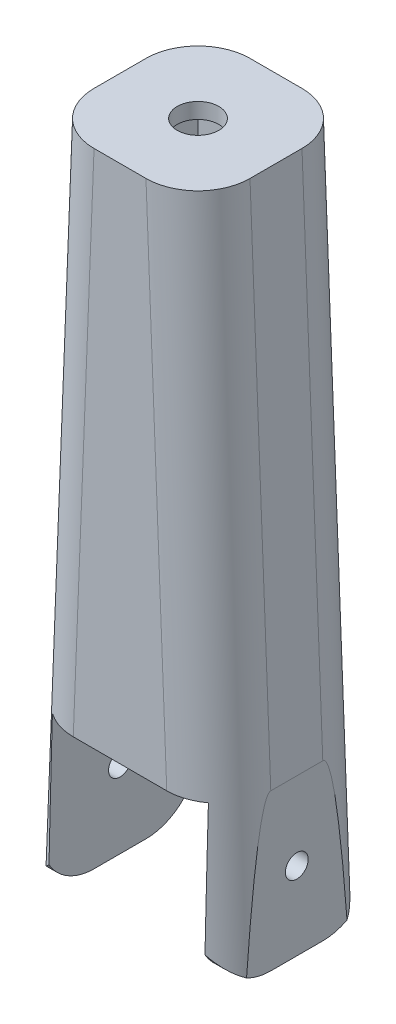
ISO-10303-21;
HEADER;
FILE_DESCRIPTION(('STEP AP214'),'2;1');
FILE_NAME('part.step','',(''),(''),'','','');
FILE_SCHEMA(('AUTOMOTIVE_DESIGN { 1 0 10303 214 1 1 1 1 }'));
ENDSEC;
DATA;
#1=APPLICATION_CONTEXT('core data for automotive mechanical design processes');
#2=APPLICATION_PROTOCOL_DEFINITION('international standard','automotive_design',2000,#1);
#3=PRODUCT_CONTEXT('',#1,'mechanical');
#4=PRODUCT('Part','Part','',(#3));
#5=PRODUCT_RELATED_PRODUCT_CATEGORY('part','',(#4));
#6=PRODUCT_DEFINITION_FORMATION('','',#4);
#7=PRODUCT_DEFINITION_CONTEXT('part definition',#1,'design');
#8=PRODUCT_DEFINITION('design','',#6,#7);
#9=PRODUCT_DEFINITION_SHAPE('','',#8);
#10=(LENGTH_UNIT() NAMED_UNIT(*) SI_UNIT(.MILLI.,.METRE.));
#11=(NAMED_UNIT(*) PLANE_ANGLE_UNIT() SI_UNIT($,.RADIAN.));
#12=(NAMED_UNIT(*) SI_UNIT($,.STERADIAN.) SOLID_ANGLE_UNIT());
#13=UNCERTAINTY_MEASURE_WITH_UNIT(LENGTH_MEASURE(1.E-05),#10,'distance_accuracy_value','');
#14=(GEOMETRIC_REPRESENTATION_CONTEXT(3) GLOBAL_UNCERTAINTY_ASSIGNED_CONTEXT((#13)) GLOBAL_UNIT_ASSIGNED_CONTEXT((#10,
#11,#12)) REPRESENTATION_CONTEXT('',''));
#15=CARTESIAN_POINT('',(0.,0.,0.));
#16=DIRECTION('',(0.,0.,1.));
#17=DIRECTION('',(1.,0.,0.));
#18=AXIS2_PLACEMENT_3D('',#15,#16,#17);
#19=CARTESIAN_POINT('',(0.,0.,0.));
#20=DIRECTION('',(0.,-1.,0.));
#21=DIRECTION('',(0.,0.,-1.));
#22=AXIS2_PLACEMENT_3D('',#19,#20,#21);
#23=PLANE('',#22);
#24=DIRECTION('',(0.,0.,1.));
#25=VECTOR('',#24,1.);
#26=CARTESIAN_POINT('',(10.,0.,10.));
#27=LINE('',#26,#25);
#28=CARTESIAN_POINT('',(10.,0.,-10.));
#29=VERTEX_POINT('',#28);
#30=CARTESIAN_POINT('',(10.,0.,10.));
#31=VERTEX_POINT('',#30);
#32=EDGE_CURVE('E198',#29,#31,#27,.T.);
#33=ORIENTED_EDGE('',*,*,#32,.F.);
#34=DIRECTION('',(1.,0.,0.));
#35=VECTOR('',#34,1.);
#36=CARTESIAN_POINT('',(10.,0.,-10.));
#37=LINE('',#36,#35);
#38=CARTESIAN_POINT('',(-10.,0.,-10.));
#39=VERTEX_POINT('',#38);
#40=EDGE_CURVE('E215',#39,#29,#37,.T.);
#41=ORIENTED_EDGE('',*,*,#40,.F.);
#42=DIRECTION('',(0.,0.,-1.));
#43=VECTOR('',#42,1.);
#44=CARTESIAN_POINT('',(-10.,0.,10.));
#45=LINE('',#44,#43);
#46=CARTESIAN_POINT('',(-10.,0.,10.));
#47=VERTEX_POINT('',#46);
#48=EDGE_CURVE('E218',#47,#39,#45,.T.);
#49=ORIENTED_EDGE('',*,*,#48,.F.);
#50=DIRECTION('',(-1.,0.,0.));
#51=VECTOR('',#50,1.);
#52=CARTESIAN_POINT('',(10.,0.,10.));
#53=LINE('',#52,#51);
#54=EDGE_CURVE('E226',#31,#47,#53,.T.);
#55=ORIENTED_EDGE('',*,*,#54,.F.);
#56=EDGE_LOOP('',(#33,#41,#49,#55));
#57=FACE_BOUND('',#56,.T.);
#58=DIRECTION('',(-1.,0.,0.));
#59=VECTOR('',#58,1.);
#60=CARTESIAN_POINT('',(-15.,0.,-15.));
#61=LINE('',#60,#59);
#62=CARTESIAN_POINT('',(8.99200319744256,0.,-15.));
#63=VERTEX_POINT('',#62);
#64=CARTESIAN_POINT('',(-8.99200319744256,0.,-15.));
#65=VERTEX_POINT('',#64);
#66=EDGE_CURVE('E270',#63,#65,#61,.T.);
#67=ORIENTED_EDGE('',*,*,#66,.F.);
#68=CARTESIAN_POINT('',(8.99200319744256,0.,-5.));
#69=DIRECTION('',(0.,-1.,0.));
#70=DIRECTION('',(-1.,0.,0.));
#71=AXIS2_PLACEMENT_3D('',#68,#69,#70);
#72=ELLIPSE('',#71,10.0079968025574,10.);
#73=CARTESIAN_POINT('',(15.,0.,-12.9976018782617));
#74=VERTEX_POINT('',#73);
#75=EDGE_CURVE('E333',#63,#74,#72,.T.);
#76=ORIENTED_EDGE('',*,*,#75,.T.);
#77=DIRECTION('',(0.,0.,1.));
#78=VECTOR('',#77,1.);
#79=CARTESIAN_POINT('',(15.,0.,15.));
#80=LINE('',#79,#78);
#81=CARTESIAN_POINT('',(15.,0.,12.9976018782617));
#82=VERTEX_POINT('',#81);
#83=EDGE_CURVE('E263',#74,#82,#80,.T.);
#84=ORIENTED_EDGE('',*,*,#83,.T.);
#85=CARTESIAN_POINT('',(8.99200319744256,0.,5.));
#86=DIRECTION('',(0.,-1.,0.));
#87=DIRECTION('',(-1.,0.,0.));
#88=AXIS2_PLACEMENT_3D('',#85,#86,#87);
#89=ELLIPSE('',#88,10.0079968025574,10.);
#90=CARTESIAN_POINT('',(8.99200319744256,0.,15.));
#91=VERTEX_POINT('',#90);
#92=EDGE_CURVE('E331',#82,#91,#89,.T.);
#93=ORIENTED_EDGE('',*,*,#92,.T.);
#94=DIRECTION('',(1.,0.,0.));
#95=VECTOR('',#94,1.);
#96=CARTESIAN_POINT('',(-15.,0.,15.));
#97=LINE('',#96,#95);
#98=CARTESIAN_POINT('',(-8.99200319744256,0.,15.));
#99=VERTEX_POINT('',#98);
#100=EDGE_CURVE('E275',#99,#91,#97,.T.);
#101=ORIENTED_EDGE('',*,*,#100,.F.);
#102=CARTESIAN_POINT('',(-8.99200319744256,0.,5.));
#103=DIRECTION('',(0.,-1.,0.));
#104=DIRECTION('',(-1.,0.,0.));
#105=AXIS2_PLACEMENT_3D('',#102,#103,#104);
#106=ELLIPSE('',#105,10.0079968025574,10.);
#107=CARTESIAN_POINT('',(-15.,0.,12.9976018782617));
#108=VERTEX_POINT('',#107);
#109=EDGE_CURVE('E327',#99,#108,#106,.T.);
#110=ORIENTED_EDGE('',*,*,#109,.T.);
#111=DIRECTION('',(0.,0.,-1.));
#112=VECTOR('',#111,1.);
#113=CARTESIAN_POINT('',(-15.,0.,-15.));
#114=LINE('',#113,#112);
#115=CARTESIAN_POINT('',(-15.,0.,-12.9976018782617));
#116=VERTEX_POINT('',#115);
#117=EDGE_CURVE('E251',#108,#116,#114,.T.);
#118=ORIENTED_EDGE('',*,*,#117,.T.);
#119=CARTESIAN_POINT('',(-8.99200319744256,0.,-5.));
#120=DIRECTION('',(0.,-1.,0.));
#121=DIRECTION('',(-1.,0.,0.));
#122=AXIS2_PLACEMENT_3D('',#119,#120,#121);
#123=ELLIPSE('',#122,10.0079968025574,10.);
#124=EDGE_CURVE('E329',#116,#65,#123,.T.);
#125=ORIENTED_EDGE('',*,*,#124,.T.);
#126=EDGE_LOOP('',(#67,#76,#84,#93,#101,#110,#118,#125));
#127=FACE_BOUND('',#126,.T.);
#128=ADVANCED_FACE('F41',(#57,#127),#23,.T.);
#129=CARTESIAN_POINT('',(-15.,100.,-15.));
#130=DIRECTION('',(0.,0.,1.));
#131=DIRECTION('',(1.,0.,0.));
#132=AXIS2_PLACEMENT_3D('',#129,#130,#131);
#133=PLANE('',#132);
#134=DIRECTION('',(-1.,0.,0.));
#135=VECTOR('',#134,1.);
#136=CARTESIAN_POINT('',(-15.,100.,-15.));
#137=LINE('',#136,#135);
#138=CARTESIAN_POINT('',(4.99200319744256,100.,-15.));
#139=VERTEX_POINT('',#138);
#140=CARTESIAN_POINT('',(-4.99200319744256,100.,-15.));
#141=VERTEX_POINT('',#140);
#142=EDGE_CURVE('E274',#139,#141,#137,.T.);
#143=ORIENTED_EDGE('',*,*,#142,.F.);
#144=DIRECTION('',(0.0399680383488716,-0.99920095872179,0.));
#145=VECTOR('',#144,1.);
#146=CARTESIAN_POINT('',(9.00799041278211,-0.399680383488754,-15.));
#147=LINE('',#146,#145);
#148=EDGE_CURVE('E324',#139,#63,#147,.T.);
#149=ORIENTED_EDGE('',*,*,#148,.T.);
#150=ORIENTED_EDGE('',*,*,#66,.T.);
#151=DIRECTION('',(0.0399680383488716,0.99920095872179,0.));
#152=VECTOR('',#151,1.);
#153=CARTESIAN_POINT('',(-5.00799041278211,99.6003196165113,-15.));
#154=LINE('',#153,#152);
#155=EDGE_CURVE('E317',#65,#141,#154,.T.);
#156=ORIENTED_EDGE('',*,*,#155,.T.);
#157=EDGE_LOOP('',(#143,#149,#150,#156));
#158=FACE_BOUND('',#157,.T.);
#159=ADVANCED_FACE('F389',(#158),#133,.F.);
#160=CARTESIAN_POINT('',(-15.,100.,15.));
#161=DIRECTION('',(0.,0.,-1.));
#162=DIRECTION('',(-1.,0.,0.));
#163=AXIS2_PLACEMENT_3D('',#160,#161,#162);
#164=PLANE('',#163);
#165=ORIENTED_EDGE('',*,*,#100,.T.);
#166=DIRECTION('',(0.0399680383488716,-0.99920095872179,0.));
#167=VECTOR('',#166,1.);
#168=CARTESIAN_POINT('',(5.0079904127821,99.6003196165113,15.));
#169=LINE('',#168,#167);
#170=CARTESIAN_POINT('',(4.99200319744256,100.,15.));
#171=VERTEX_POINT('',#170);
#172=EDGE_CURVE('E362',#91,#171,#169,.F.);
#173=ORIENTED_EDGE('',*,*,#172,.T.);
#174=DIRECTION('',(1.,0.,0.));
#175=VECTOR('',#174,1.);
#176=CARTESIAN_POINT('',(-15.,100.,15.));
#177=LINE('',#176,#175);
#178=CARTESIAN_POINT('',(-4.99200319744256,100.,15.));
#179=VERTEX_POINT('',#178);
#180=EDGE_CURVE('E281',#179,#171,#177,.T.);
#181=ORIENTED_EDGE('',*,*,#180,.F.);
#182=DIRECTION('',(0.0399680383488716,0.99920095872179,0.));
#183=VECTOR('',#182,1.);
#184=CARTESIAN_POINT('',(-9.00799041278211,-0.399680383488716,15.));
#185=LINE('',#184,#183);
#186=EDGE_CURVE('E360',#179,#99,#185,.F.);
#187=ORIENTED_EDGE('',*,*,#186,.T.);
#188=EDGE_LOOP('',(#165,#173,#181,#187));
#189=FACE_BOUND('',#188,.T.);
#190=ADVANCED_FACE('F429',(#189),#164,.F.);
#191=CARTESIAN_POINT('',(0.,100.,0.));
#192=DIRECTION('',(0.,-1.,0.));
#193=DIRECTION('',(0.,0.,-1.));
#194=AXIS2_PLACEMENT_3D('',#191,#192,#193);
#195=PLANE('',#194);
#196=CARTESIAN_POINT('',(0.,100.,0.));
#197=DIRECTION('',(0.,1.,0.));
#198=DIRECTION('',(0.,0.,1.));
#199=AXIS2_PLACEMENT_3D('',#196,#197,#198);
#200=CIRCLE('',#199,4.);
#201=CARTESIAN_POINT('',(0.,100.,4.));
#202=VERTEX_POINT('',#201);
#203=EDGE_CURVE('E221',#202,#202,#200,.T.);
#204=ORIENTED_EDGE('',*,*,#203,.F.);
#205=EDGE_LOOP('',(#204));
#206=FACE_BOUND('',#205,.T.);
#207=DIRECTION('',(0.,0.,-1.));
#208=VECTOR('',#207,1.);
#209=CARTESIAN_POINT('',(15.,100.,15.));
#210=LINE('',#209,#208);
#211=CARTESIAN_POINT('',(15.,100.,5.));
#212=VERTEX_POINT('',#211);
#213=CARTESIAN_POINT('',(15.,100.,-5.));
#214=VERTEX_POINT('',#213);
#215=EDGE_CURVE('E271',#212,#214,#210,.T.);
#216=ORIENTED_EDGE('',*,*,#215,.T.);
#217=CARTESIAN_POINT('',(4.99200319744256,100.,-5.));
#218=DIRECTION('',(0.,-1.,0.));
#219=DIRECTION('',(-1.,0.,0.));
#220=AXIS2_PLACEMENT_3D('',#217,#218,#219);
#221=ELLIPSE('',#220,10.0079968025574,10.);
#222=EDGE_CURVE('E356',#214,#139,#221,.F.);
#223=ORIENTED_EDGE('',*,*,#222,.T.);
#224=ORIENTED_EDGE('',*,*,#142,.T.);
#225=CARTESIAN_POINT('',(-4.99200319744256,100.,-5.));
#226=DIRECTION('',(0.,-1.,0.));
#227=DIRECTION('',(-1.,0.,0.));
#228=AXIS2_PLACEMENT_3D('',#225,#226,#227);
#229=ELLIPSE('',#228,10.0079968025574,10.);
#230=CARTESIAN_POINT('',(-15.,100.,-5.));
#231=VERTEX_POINT('',#230);
#232=EDGE_CURVE('E352',#141,#231,#229,.F.);
#233=ORIENTED_EDGE('',*,*,#232,.T.);
#234=DIRECTION('',(0.,0.,1.));
#235=VECTOR('',#234,1.);
#236=CARTESIAN_POINT('',(-15.,100.,15.));
#237=LINE('',#236,#235);
#238=CARTESIAN_POINT('',(-15.,100.,5.));
#239=VERTEX_POINT('',#238);
#240=EDGE_CURVE('E278',#231,#239,#237,.T.);
#241=ORIENTED_EDGE('',*,*,#240,.T.);
#242=CARTESIAN_POINT('',(-4.99200319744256,100.,5.));
#243=DIRECTION('',(0.,-1.,0.));
#244=DIRECTION('',(-1.,0.,0.));
#245=AXIS2_PLACEMENT_3D('',#242,#243,#244);
#246=ELLIPSE('',#245,10.0079968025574,10.);
#247=EDGE_CURVE('E350',#239,#179,#246,.F.);
#248=ORIENTED_EDGE('',*,*,#247,.T.);
#249=ORIENTED_EDGE('',*,*,#180,.T.);
#250=CARTESIAN_POINT('',(4.99200319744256,100.,5.));
#251=DIRECTION('',(0.,-1.,0.));
#252=DIRECTION('',(-1.,0.,0.));
#253=AXIS2_PLACEMENT_3D('',#250,#251,#252);
#254=ELLIPSE('',#253,10.0079968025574,10.);
#255=EDGE_CURVE('E354',#171,#212,#254,.F.);
#256=ORIENTED_EDGE('',*,*,#255,.T.);
#257=EDGE_LOOP('',(#216,#223,#224,#233,#241,#248,#249,#256));
#258=FACE_BOUND('',#257,.T.);
#259=ADVANCED_FACE('F392',(#206,#258),#195,.F.);
#260=CARTESIAN_POINT('',(19.,0.,15.));
#261=DIRECTION('',(0.999200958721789,0.0399680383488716,0.));
#262=DIRECTION('',(-0.0399680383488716,0.99920095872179,0.));
#263=AXIS2_PLACEMENT_3D('',#260,#261,#262);
#264=PLANE('',#263);
#265=DIRECTION('',(0.,0.,-1.));
#266=VECTOR('',#265,1.);
#267=CARTESIAN_POINT('',(19.,0.,15.));
#268=LINE('',#267,#266);
#269=CARTESIAN_POINT('',(19.,0.,5.));
#270=VERTEX_POINT('',#269);
#271=CARTESIAN_POINT('',(19.,0.,-5.));
#272=VERTEX_POINT('',#271);
#273=EDGE_CURVE('E262',#270,#272,#268,.T.);
#274=ORIENTED_EDGE('',*,*,#273,.T.);
#275=DIRECTION('',(0.0399680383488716,-0.99920095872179,0.));
#276=VECTOR('',#275,1.);
#277=CARTESIAN_POINT('',(15.,100.,-5.));
#278=LINE('',#277,#276);
#279=EDGE_CURVE('E348',#272,#214,#278,.F.);
#280=ORIENTED_EDGE('',*,*,#279,.T.);
#281=ORIENTED_EDGE('',*,*,#215,.F.);
#282=DIRECTION('',(0.0399680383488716,-0.99920095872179,0.));
#283=VECTOR('',#282,1.);
#284=CARTESIAN_POINT('',(19.,0.,5.));
#285=LINE('',#284,#283);
#286=EDGE_CURVE('E345',#212,#270,#285,.T.);
#287=ORIENTED_EDGE('',*,*,#286,.T.);
#288=EDGE_LOOP('',(#274,#280,#281,#287));
#289=FACE_BOUND('',#288,.T.);
#290=ADVANCED_FACE('F452',(#289),#264,.T.);
#291=CARTESIAN_POINT('',(19.,-30.,15.));
#292=DIRECTION('',(0.,1.,0.));
#293=DIRECTION('',(0.,0.,1.));
#294=AXIS2_PLACEMENT_3D('',#291,#292,#293);
#295=PLANE('',#294);
#296=DIRECTION('',(0.,0.,-1.));
#297=VECTOR('',#296,1.);
#298=CARTESIAN_POINT('',(19.,-30.,15.));
#299=LINE('',#298,#297);
#300=CARTESIAN_POINT('',(19.,-30.,5.));
#301=VERTEX_POINT('',#300);
#302=CARTESIAN_POINT('',(19.,-30.,-5.));
#303=VERTEX_POINT('',#302);
#304=EDGE_CURVE('E259',#301,#303,#299,.T.);
#305=ORIENTED_EDGE('',*,*,#304,.F.);
#306=DIRECTION('',(-1.,0.,0.));
#307=VECTOR('',#306,1.);
#308=CARTESIAN_POINT('',(19.,-30.,5.));
#309=LINE('',#308,#307);
#310=CARTESIAN_POINT('',(15.,-30.,5.));
#311=VERTEX_POINT('',#310);
#312=EDGE_CURVE('E304',#301,#311,#309,.T.);
#313=ORIENTED_EDGE('',*,*,#312,.T.);
#314=DIRECTION('',(0.,0.,-1.));
#315=VECTOR('',#314,1.);
#316=CARTESIAN_POINT('',(15.,-30.,15.));
#317=LINE('',#316,#315);
#318=CARTESIAN_POINT('',(15.,-30.,-5.));
#319=VERTEX_POINT('',#318);
#320=EDGE_CURVE('E258',#311,#319,#317,.T.);
#321=ORIENTED_EDGE('',*,*,#320,.T.);
#322=DIRECTION('',(-1.,0.,0.));
#323=VECTOR('',#322,1.);
#324=CARTESIAN_POINT('',(19.,-30.,-5.));
#325=LINE('',#324,#323);
#326=EDGE_CURVE('E302',#319,#303,#325,.F.);
#327=ORIENTED_EDGE('',*,*,#326,.T.);
#328=EDGE_LOOP('',(#305,#313,#321,#327));
#329=FACE_BOUND('',#328,.T.);
#330=ADVANCED_FACE('F419',(#329),#295,.F.);
#331=CARTESIAN_POINT('',(19.,0.,0.));
#332=DIRECTION('',(1.,0.,0.));
#333=DIRECTION('',(0.,0.,-1.));
#334=AXIS2_PLACEMENT_3D('',#331,#332,#333);
#335=PLANE('',#334);
#336=CARTESIAN_POINT('',(19.,-15.,0.));
#337=DIRECTION('',(1.,0.,0.));
#338=DIRECTION('',(0.,0.,-1.));
#339=AXIS2_PLACEMENT_3D('',#336,#337,#338);
#340=CIRCLE('',#339,2.2);
#341=CARTESIAN_POINT('',(19.,-15.,-2.2));
#342=VERTEX_POINT('',#341);
#343=EDGE_CURVE('E233',#342,#342,#340,.T.);
#344=ORIENTED_EDGE('',*,*,#343,.F.);
#345=EDGE_LOOP('',(#344));
#346=FACE_BOUND('',#345,.T.);
#347=CARTESIAN_POINT('',(19.,-20.,-5.));
#348=DIRECTION('',(1.,0.,0.));
#349=DIRECTION('',(0.,0.,-1.));
#350=AXIS2_PLACEMENT_3D('',#347,#348,#349);
#351=CIRCLE('',#350,10.);
#352=CARTESIAN_POINT('',(19.,-28.8470403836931,-9.6615315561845));
#353=VERTEX_POINT('',#352);
#354=EDGE_CURVE('E312',#303,#353,#351,.T.);
#355=ORIENTED_EDGE('',*,*,#354,.T.);
#356=CARTESIAN_POINT('',(19.,-250.199920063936,-5.));
#357=DIRECTION('',(1.,0.,0.));
#358=DIRECTION('',(0.,1.,0.));
#359=AXIS2_PLACEMENT_3D('',#356,#357,#358);
#360=ELLIPSE('',#359,250.199920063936,10.);
#361=EDGE_CURVE('E343',#353,#272,#360,.T.);
#362=ORIENTED_EDGE('',*,*,#361,.T.);
#363=ORIENTED_EDGE('',*,*,#273,.F.);
#364=CARTESIAN_POINT('',(19.,-250.199920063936,5.));
#365=DIRECTION('',(1.,0.,0.));
#366=DIRECTION('',(0.,1.,0.));
#367=AXIS2_PLACEMENT_3D('',#364,#365,#366);
#368=ELLIPSE('',#367,250.199920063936,10.);
#369=CARTESIAN_POINT('',(19.,-28.8470403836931,9.66153155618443));
#370=VERTEX_POINT('',#369);
#371=EDGE_CURVE('E341',#270,#370,#368,.T.);
#372=ORIENTED_EDGE('',*,*,#371,.T.);
#373=CARTESIAN_POINT('',(19.,-20.,5.));
#374=DIRECTION('',(1.,0.,0.));
#375=DIRECTION('',(0.,0.,-1.));
#376=AXIS2_PLACEMENT_3D('',#373,#374,#375);
#377=CIRCLE('',#376,10.);
#378=EDGE_CURVE('E315',#370,#301,#377,.T.);
#379=ORIENTED_EDGE('',*,*,#378,.T.);
#380=ORIENTED_EDGE('',*,*,#304,.T.);
#381=EDGE_LOOP('',(#355,#362,#363,#372,#379,#380));
#382=FACE_BOUND('',#381,.T.);
#383=ADVANCED_FACE('F413',(#346,#382),#335,.T.);
#384=CARTESIAN_POINT('',(15.,0.,0.));
#385=DIRECTION('',(1.,0.,0.));
#386=DIRECTION('',(0.,0.,-1.));
#387=AXIS2_PLACEMENT_3D('',#384,#385,#386);
#388=PLANE('',#387);
#389=CARTESIAN_POINT('',(15.,-15.,0.));
#390=DIRECTION('',(1.,0.,0.));
#391=DIRECTION('',(0.,0.,-1.));
#392=AXIS2_PLACEMENT_3D('',#389,#390,#391);
#393=CIRCLE('',#392,2.2);
#394=CARTESIAN_POINT('',(15.,-15.,-2.2));
#395=VERTEX_POINT('',#394);
#396=EDGE_CURVE('E243',#395,#395,#393,.T.);
#397=ORIENTED_EDGE('',*,*,#396,.T.);
#398=EDGE_LOOP('',(#397));
#399=FACE_BOUND('',#398,.T.);
#400=ORIENTED_EDGE('',*,*,#83,.F.);
#401=CARTESIAN_POINT('',(15.,-150.199920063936,-5.));
#402=DIRECTION('',(1.,0.,0.));
#403=DIRECTION('',(0.,1.,0.));
#404=AXIS2_PLACEMENT_3D('',#401,#402,#403);
#405=ELLIPSE('',#404,250.199920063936,10.);
#406=CARTESIAN_POINT('',(15.,-25.0038416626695,-13.6580349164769));
#407=VERTEX_POINT('',#406);
#408=EDGE_CURVE('E337',#74,#407,#405,.F.);
#409=ORIENTED_EDGE('',*,*,#408,.T.);
#410=CARTESIAN_POINT('',(15.,-20.,-5.));
#411=DIRECTION('',(1.,0.,0.));
#412=DIRECTION('',(0.,0.,-1.));
#413=AXIS2_PLACEMENT_3D('',#410,#411,#412);
#414=CIRCLE('',#413,10.);
#415=EDGE_CURVE('E307',#407,#319,#414,.F.);
#416=ORIENTED_EDGE('',*,*,#415,.T.);
#417=ORIENTED_EDGE('',*,*,#320,.F.);
#418=CARTESIAN_POINT('',(15.,-20.,5.));
#419=DIRECTION('',(1.,0.,0.));
#420=DIRECTION('',(0.,0.,-1.));
#421=AXIS2_PLACEMENT_3D('',#418,#419,#420);
#422=CIRCLE('',#421,10.);
#423=CARTESIAN_POINT('',(15.,-25.0038416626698,13.6580349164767));
#424=VERTEX_POINT('',#423);
#425=EDGE_CURVE('E309',#311,#424,#422,.F.);
#426=ORIENTED_EDGE('',*,*,#425,.T.);
#427=CARTESIAN_POINT('',(15.,-150.199920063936,5.));
#428=DIRECTION('',(1.,0.,0.));
#429=DIRECTION('',(0.,1.,0.));
#430=AXIS2_PLACEMENT_3D('',#427,#428,#429);
#431=ELLIPSE('',#430,250.199920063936,10.);
#432=EDGE_CURVE('E335',#424,#82,#431,.F.);
#433=ORIENTED_EDGE('',*,*,#432,.T.);
#434=EDGE_LOOP('',(#400,#409,#416,#417,#426,#433));
#435=FACE_BOUND('',#434,.T.);
#436=ADVANCED_FACE('F404',(#399,#435),#388,.F.);
#437=CARTESIAN_POINT('',(-19.,0.,15.));
#438=DIRECTION('',(-0.999200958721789,0.0399680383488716,0.));
#439=DIRECTION('',(-0.0399680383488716,-0.99920095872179,0.));
#440=AXIS2_PLACEMENT_3D('',#437,#438,#439);
#441=PLANE('',#440);
#442=ORIENTED_EDGE('',*,*,#240,.F.);
#443=DIRECTION('',(0.0399680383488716,0.99920095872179,0.));
#444=VECTOR('',#443,1.);
#445=CARTESIAN_POINT('',(-19.,0.,-5.));
#446=LINE('',#445,#444);
#447=CARTESIAN_POINT('',(-19.,0.,-5.));
#448=VERTEX_POINT('',#447);
#449=EDGE_CURVE('E367',#231,#448,#446,.F.);
#450=ORIENTED_EDGE('',*,*,#449,.T.);
#451=DIRECTION('',(0.,0.,-1.));
#452=VECTOR('',#451,1.);
#453=CARTESIAN_POINT('',(-19.,0.,15.));
#454=LINE('',#453,#452);
#455=CARTESIAN_POINT('',(-19.,0.,5.));
#456=VERTEX_POINT('',#455);
#457=EDGE_CURVE('E250',#456,#448,#454,.T.);
#458=ORIENTED_EDGE('',*,*,#457,.F.);
#459=DIRECTION('',(0.0399680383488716,0.99920095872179,0.));
#460=VECTOR('',#459,1.);
#461=CARTESIAN_POINT('',(-15.,100.,5.));
#462=LINE('',#461,#460);
#463=EDGE_CURVE('E364',#456,#239,#462,.T.);
#464=ORIENTED_EDGE('',*,*,#463,.T.);
#465=EDGE_LOOP('',(#442,#450,#458,#464));
#466=FACE_BOUND('',#465,.T.);
#467=ADVANCED_FACE('F449',(#466),#441,.T.);
#468=CARTESIAN_POINT('',(-19.,-30.,-15.));
#469=DIRECTION('',(0.,1.,0.));
#470=DIRECTION('',(0.,0.,1.));
#471=AXIS2_PLACEMENT_3D('',#468,#469,#470);
#472=PLANE('',#471);
#473=DIRECTION('',(0.,0.,1.));
#474=VECTOR('',#473,1.);
#475=CARTESIAN_POINT('',(-15.,-30.,-15.));
#476=LINE('',#475,#474);
#477=CARTESIAN_POINT('',(-15.,-30.,-5.));
#478=VERTEX_POINT('',#477);
#479=CARTESIAN_POINT('',(-15.,-30.,4.99999999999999));
#480=VERTEX_POINT('',#479);
#481=EDGE_CURVE('E246',#478,#480,#476,.T.);
#482=ORIENTED_EDGE('',*,*,#481,.T.);
#483=DIRECTION('',(1.,0.,0.));
#484=VECTOR('',#483,1.);
#485=CARTESIAN_POINT('',(-19.,-30.,5.));
#486=LINE('',#485,#484);
#487=CARTESIAN_POINT('',(-19.,-30.,4.99999999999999));
#488=VERTEX_POINT('',#487);
#489=EDGE_CURVE('E295',#480,#488,#486,.F.);
#490=ORIENTED_EDGE('',*,*,#489,.T.);
#491=DIRECTION('',(0.,0.,1.));
#492=VECTOR('',#491,1.);
#493=CARTESIAN_POINT('',(-19.,-30.,-15.));
#494=LINE('',#493,#492);
#495=CARTESIAN_POINT('',(-19.,-30.,-5.));
#496=VERTEX_POINT('',#495);
#497=EDGE_CURVE('E247',#496,#488,#494,.T.);
#498=ORIENTED_EDGE('',*,*,#497,.F.);
#499=DIRECTION('',(1.,0.,0.));
#500=VECTOR('',#499,1.);
#501=CARTESIAN_POINT('',(-19.,-30.,-5.));
#502=LINE('',#501,#500);
#503=EDGE_CURVE('E292',#496,#478,#502,.T.);
#504=ORIENTED_EDGE('',*,*,#503,.T.);
#505=EDGE_LOOP('',(#482,#490,#498,#504));
#506=FACE_BOUND('',#505,.T.);
#507=ADVANCED_FACE('F446',(#506),#472,.F.);
#508=CARTESIAN_POINT('',(-19.,0.,0.));
#509=DIRECTION('',(-1.,0.,0.));
#510=DIRECTION('',(0.,0.,1.));
#511=AXIS2_PLACEMENT_3D('',#508,#509,#510);
#512=PLANE('',#511);
#513=CARTESIAN_POINT('',(-19.,-15.,0.));
#514=DIRECTION('',(1.,0.,0.));
#515=DIRECTION('',(0.,0.,-1.));
#516=AXIS2_PLACEMENT_3D('',#513,#514,#515);
#517=CIRCLE('',#516,2.2);
#518=CARTESIAN_POINT('',(-19.,-15.,-2.2));
#519=VERTEX_POINT('',#518);
#520=EDGE_CURVE('E237',#519,#519,#517,.T.);
#521=ORIENTED_EDGE('',*,*,#520,.T.);
#522=EDGE_LOOP('',(#521));
#523=FACE_BOUND('',#522,.T.);
#524=ORIENTED_EDGE('',*,*,#457,.T.);
#525=CARTESIAN_POINT('',(-19.,-250.199920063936,-5.));
#526=DIRECTION('',(-1.,0.,0.));
#527=DIRECTION('',(0.,-1.,0.));
#528=AXIS2_PLACEMENT_3D('',#525,#526,#527);
#529=ELLIPSE('',#528,250.199920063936,10.);
#530=CARTESIAN_POINT('',(-19.,-28.8470403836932,-9.66153155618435));
#531=VERTEX_POINT('',#530);
#532=EDGE_CURVE('E371',#448,#531,#529,.T.);
#533=ORIENTED_EDGE('',*,*,#532,.T.);
#534=CARTESIAN_POINT('',(-19.,-20.,-5.));
#535=DIRECTION('',(-1.,0.,0.));
#536=DIRECTION('',(0.,0.,1.));
#537=AXIS2_PLACEMENT_3D('',#534,#535,#536);
#538=CIRCLE('',#537,10.);
#539=EDGE_CURVE('E297',#531,#496,#538,.T.);
#540=ORIENTED_EDGE('',*,*,#539,.T.);
#541=ORIENTED_EDGE('',*,*,#497,.T.);
#542=CARTESIAN_POINT('',(-19.,-20.,5.));
#543=DIRECTION('',(-1.,0.,0.));
#544=DIRECTION('',(0.,0.,1.));
#545=AXIS2_PLACEMENT_3D('',#542,#543,#544);
#546=CIRCLE('',#545,10.);
#547=CARTESIAN_POINT('',(-19.,-28.8470403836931,9.66153155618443));
#548=VERTEX_POINT('',#547);
#549=EDGE_CURVE('E299',#488,#548,#546,.T.);
#550=ORIENTED_EDGE('',*,*,#549,.T.);
#551=CARTESIAN_POINT('',(-19.,-250.199920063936,5.));
#552=DIRECTION('',(-1.,0.,0.));
#553=DIRECTION('',(0.,-1.,0.));
#554=AXIS2_PLACEMENT_3D('',#551,#552,#553);
#555=ELLIPSE('',#554,250.199920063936,10.);
#556=EDGE_CURVE('E369',#548,#456,#555,.T.);
#557=ORIENTED_EDGE('',*,*,#556,.T.);
#558=EDGE_LOOP('',(#524,#533,#540,#541,#550,#557));
#559=FACE_BOUND('',#558,.T.);
#560=ADVANCED_FACE('F441',(#523,#559),#512,.T.);
#561=CARTESIAN_POINT('',(-15.,0.,0.));
#562=DIRECTION('',(-1.,0.,0.));
#563=DIRECTION('',(0.,0.,1.));
#564=AXIS2_PLACEMENT_3D('',#561,#562,#563);
#565=PLANE('',#564);
#566=CARTESIAN_POINT('',(-15.,-15.,0.));
#567=DIRECTION('',(-1.,0.,0.));
#568=DIRECTION('',(0.,0.,1.));
#569=AXIS2_PLACEMENT_3D('',#566,#567,#568);
#570=CIRCLE('',#569,2.2);
#571=CARTESIAN_POINT('',(-15.,-15.,2.2));
#572=VERTEX_POINT('',#571);
#573=EDGE_CURVE('E240',#572,#572,#570,.T.);
#574=ORIENTED_EDGE('',*,*,#573,.T.);
#575=EDGE_LOOP('',(#574));
#576=FACE_BOUND('',#575,.T.);
#577=CARTESIAN_POINT('',(-15.,-20.,-5.));
#578=DIRECTION('',(-1.,0.,0.));
#579=DIRECTION('',(0.,0.,1.));
#580=AXIS2_PLACEMENT_3D('',#577,#578,#579);
#581=CIRCLE('',#580,10.);
#582=CARTESIAN_POINT('',(-15.,-25.0038416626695,-13.6580349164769));
#583=VERTEX_POINT('',#582);
#584=EDGE_CURVE('E284',#478,#583,#581,.F.);
#585=ORIENTED_EDGE('',*,*,#584,.T.);
#586=CARTESIAN_POINT('',(-15.,-150.199920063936,-5.));
#587=DIRECTION('',(-1.,0.,0.));
#588=DIRECTION('',(0.,-1.,0.));
#589=AXIS2_PLACEMENT_3D('',#586,#587,#588);
#590=ELLIPSE('',#589,250.199920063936,10.);
#591=EDGE_CURVE('E49',#583,#116,#590,.F.);
#592=ORIENTED_EDGE('',*,*,#591,.T.);
#593=ORIENTED_EDGE('',*,*,#117,.F.);
#594=CARTESIAN_POINT('',(-15.,-150.199920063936,5.));
#595=DIRECTION('',(-1.,0.,0.));
#596=DIRECTION('',(0.,-1.,0.));
#597=AXIS2_PLACEMENT_3D('',#594,#595,#596);
#598=ELLIPSE('',#597,250.199920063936,10.);
#599=CARTESIAN_POINT('',(-15.,-25.0038416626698,13.6580349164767));
#600=VERTEX_POINT('',#599);
#601=EDGE_CURVE('E56',#108,#600,#598,.F.);
#602=ORIENTED_EDGE('',*,*,#601,.T.);
#603=CARTESIAN_POINT('',(-15.,-20.,5.));
#604=DIRECTION('',(-1.,0.,0.));
#605=DIRECTION('',(0.,0.,1.));
#606=AXIS2_PLACEMENT_3D('',#603,#604,#605);
#607=CIRCLE('',#606,10.);
#608=EDGE_CURVE('E290',#600,#480,#607,.F.);
#609=ORIENTED_EDGE('',*,*,#608,.T.);
#610=ORIENTED_EDGE('',*,*,#481,.F.);
#611=EDGE_LOOP('',(#585,#592,#593,#602,#609,#610));
#612=FACE_BOUND('',#611,.T.);
#613=ADVANCED_FACE('F375',(#576,#612),#565,.F.);
#614=CARTESIAN_POINT('',(-15.,-20.,5.));
#615=DIRECTION('',(1.,0.,0.));
#616=DIRECTION('',(0.,0.,-1.));
#617=AXIS2_PLACEMENT_3D('',#614,#615,#616);
#618=CYLINDRICAL_SURFACE('',#617,10.);
#619=ORIENTED_EDGE('',*,*,#608,.F.);
#620=CARTESIAN_POINT('',(-9.79200319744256,-20.,5.));
#621=DIRECTION('',(0.692831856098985,-0.721099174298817,0.));
#622=DIRECTION('',(0.721099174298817,0.692831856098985,0.));
#623=AXIS2_PLACEMENT_3D('',#620,#621,#622);
#624=ELLIPSE('',#623,14.4335164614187,10.);
#625=EDGE_CURVE('E11',#600,#548,#624,.T.);
#626=ORIENTED_EDGE('',*,*,#625,.T.);
#627=ORIENTED_EDGE('',*,*,#549,.F.);
#628=ORIENTED_EDGE('',*,*,#489,.F.);
#629=EDGE_LOOP('',(#619,#626,#627,#628));
#630=FACE_BOUND('',#629,.T.);
#631=ADVANCED_FACE('F438',(#630),#618,.T.);
#632=CARTESIAN_POINT('',(19.,-20.,5.));
#633=DIRECTION('',(-1.,0.,0.));
#634=DIRECTION('',(0.,0.,1.));
#635=AXIS2_PLACEMENT_3D('',#632,#633,#634);
#636=CYLINDRICAL_SURFACE('',#635,10.);
#637=ORIENTED_EDGE('',*,*,#378,.F.);
#638=CARTESIAN_POINT('',(9.79200319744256,-20.,5.));
#639=DIRECTION('',(-0.692831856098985,-0.721099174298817,0.));
#640=DIRECTION('',(-0.721099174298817,0.692831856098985,0.));
#641=AXIS2_PLACEMENT_3D('',#638,#639,#640);
#642=ELLIPSE('',#641,14.4335164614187,10.);
#643=EDGE_CURVE('E358',#370,#424,#642,.T.);
#644=ORIENTED_EDGE('',*,*,#643,.T.);
#645=ORIENTED_EDGE('',*,*,#425,.F.);
#646=ORIENTED_EDGE('',*,*,#312,.F.);
#647=EDGE_LOOP('',(#637,#644,#645,#646));
#648=FACE_BOUND('',#647,.T.);
#649=ADVANCED_FACE('F422',(#648),#636,.T.);
#650=CARTESIAN_POINT('',(-19.,-20.,-5.));
#651=DIRECTION('',(1.,0.,0.));
#652=DIRECTION('',(0.,0.,-1.));
#653=AXIS2_PLACEMENT_3D('',#650,#651,#652);
#654=CYLINDRICAL_SURFACE('',#653,10.);
#655=ORIENTED_EDGE('',*,*,#539,.F.);
#656=CARTESIAN_POINT('',(-9.79200319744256,-20.,-5.));
#657=DIRECTION('',(0.692831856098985,-0.721099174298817,0.));
#658=DIRECTION('',(0.721099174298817,0.692831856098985,0.));
#659=AXIS2_PLACEMENT_3D('',#656,#657,#658);
#660=ELLIPSE('',#659,14.4335164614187,10.);
#661=EDGE_CURVE('E64',#531,#583,#660,.T.);
#662=ORIENTED_EDGE('',*,*,#661,.T.);
#663=ORIENTED_EDGE('',*,*,#584,.F.);
#664=ORIENTED_EDGE('',*,*,#503,.F.);
#665=EDGE_LOOP('',(#655,#662,#663,#664));
#666=FACE_BOUND('',#665,.T.);
#667=ADVANCED_FACE('F447',(#666),#654,.T.);
#668=CARTESIAN_POINT('',(-15.,-20.,-5.));
#669=DIRECTION('',(-1.,0.,0.));
#670=DIRECTION('',(0.,0.,1.));
#671=AXIS2_PLACEMENT_3D('',#668,#669,#670);
#672=CYLINDRICAL_SURFACE('',#671,10.);
#673=ORIENTED_EDGE('',*,*,#415,.F.);
#674=CARTESIAN_POINT('',(9.79200319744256,-20.,-5.));
#675=DIRECTION('',(-0.692831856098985,-0.721099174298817,0.));
#676=DIRECTION('',(-0.721099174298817,0.692831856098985,0.));
#677=AXIS2_PLACEMENT_3D('',#674,#675,#676);
#678=ELLIPSE('',#677,14.4335164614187,10.);
#679=EDGE_CURVE('E339',#407,#353,#678,.T.);
#680=ORIENTED_EDGE('',*,*,#679,.T.);
#681=ORIENTED_EDGE('',*,*,#354,.F.);
#682=ORIENTED_EDGE('',*,*,#326,.F.);
#683=EDGE_LOOP('',(#673,#680,#681,#682));
#684=FACE_BOUND('',#683,.T.);
#685=ADVANCED_FACE('F410',(#684),#672,.T.);
#686=CARTESIAN_POINT('',(-19.,-15.,0.));
#687=DIRECTION('',(1.,0.,0.));
#688=DIRECTION('',(0.,0.,-1.));
#689=AXIS2_PLACEMENT_3D('',#686,#687,#688);
#690=CYLINDRICAL_SURFACE('',#689,2.2);
#691=ORIENTED_EDGE('',*,*,#520,.F.);
#692=EDGE_LOOP('',(#691));
#693=FACE_BOUND('',#692,.T.);
#694=ORIENTED_EDGE('',*,*,#573,.F.);
#695=EDGE_LOOP('',(#694));
#696=FACE_BOUND('',#695,.T.);
#697=ADVANCED_FACE('F482',(#693,#696),#690,.F.);
#698=ORIENTED_EDGE('',*,*,#343,.T.);
#699=EDGE_LOOP('',(#698));
#700=FACE_BOUND('',#699,.T.);
#701=ORIENTED_EDGE('',*,*,#396,.F.);
#702=EDGE_LOOP('',(#701));
#703=FACE_BOUND('',#702,.T.);
#704=ADVANCED_FACE('F564',(#700,#703),#690,.F.);
#705=CARTESIAN_POINT('',(10.,97.,10.));
#706=DIRECTION('',(1.,0.,0.));
#707=DIRECTION('',(0.,0.,-1.));
#708=AXIS2_PLACEMENT_3D('',#705,#706,#707);
#709=PLANE('',#708);
#710=ORIENTED_EDGE('',*,*,#32,.T.);
#711=DIRECTION('',(0.,-1.,0.));
#712=VECTOR('',#711,1.);
#713=CARTESIAN_POINT('',(10.,97.,10.));
#714=LINE('',#713,#712);
#715=CARTESIAN_POINT('',(10.,97.,10.));
#716=VERTEX_POINT('',#715);
#717=EDGE_CURVE('E191',#716,#31,#714,.T.);
#718=ORIENTED_EDGE('',*,*,#717,.F.);
#719=DIRECTION('',(0.,0.,1.));
#720=VECTOR('',#719,1.);
#721=CARTESIAN_POINT('',(10.,97.,10.));
#722=LINE('',#721,#720);
#723=CARTESIAN_POINT('',(10.,97.,-10.));
#724=VERTEX_POINT('',#723);
#725=EDGE_CURVE('E195',#724,#716,#722,.T.);
#726=ORIENTED_EDGE('',*,*,#725,.F.);
#727=DIRECTION('',(0.,-1.,0.));
#728=VECTOR('',#727,1.);
#729=CARTESIAN_POINT('',(10.,97.,-10.));
#730=LINE('',#729,#728);
#731=EDGE_CURVE('E231',#724,#29,#730,.T.);
#732=ORIENTED_EDGE('',*,*,#731,.T.);
#733=EDGE_LOOP('',(#710,#718,#726,#732));
#734=FACE_BOUND('',#733,.T.);
#735=ADVANCED_FACE('F193',(#734),#709,.F.);
#736=CARTESIAN_POINT('',(10.,97.,-10.));
#737=DIRECTION('',(0.,0.,-1.));
#738=DIRECTION('',(-1.,0.,0.));
#739=AXIS2_PLACEMENT_3D('',#736,#737,#738);
#740=PLANE('',#739);
#741=ORIENTED_EDGE('',*,*,#40,.T.);
#742=ORIENTED_EDGE('',*,*,#731,.F.);
#743=DIRECTION('',(1.,0.,0.));
#744=VECTOR('',#743,1.);
#745=CARTESIAN_POINT('',(10.,97.,-10.));
#746=LINE('',#745,#744);
#747=CARTESIAN_POINT('',(-10.,97.,-10.));
#748=VERTEX_POINT('',#747);
#749=EDGE_CURVE('E203',#748,#724,#746,.T.);
#750=ORIENTED_EDGE('',*,*,#749,.F.);
#751=DIRECTION('',(0.,-1.,0.));
#752=VECTOR('',#751,1.);
#753=CARTESIAN_POINT('',(-10.,97.,-10.));
#754=LINE('',#753,#752);
#755=EDGE_CURVE('E234',#748,#39,#754,.T.);
#756=ORIENTED_EDGE('',*,*,#755,.T.);
#757=EDGE_LOOP('',(#741,#742,#750,#756));
#758=FACE_BOUND('',#757,.T.);
#759=ADVANCED_FACE('F545',(#758),#740,.F.);
#760=CARTESIAN_POINT('',(-10.,97.,10.));
#761=DIRECTION('',(-1.,0.,0.));
#762=DIRECTION('',(0.,0.,1.));
#763=AXIS2_PLACEMENT_3D('',#760,#761,#762);
#764=PLANE('',#763);
#765=ORIENTED_EDGE('',*,*,#48,.T.);
#766=ORIENTED_EDGE('',*,*,#755,.F.);
#767=DIRECTION('',(0.,0.,-1.));
#768=VECTOR('',#767,1.);
#769=CARTESIAN_POINT('',(-10.,97.,10.));
#770=LINE('',#769,#768);
#771=CARTESIAN_POINT('',(-10.,97.,10.));
#772=VERTEX_POINT('',#771);
#773=EDGE_CURVE('E211',#772,#748,#770,.T.);
#774=ORIENTED_EDGE('',*,*,#773,.F.);
#775=DIRECTION('',(0.,-1.,0.));
#776=VECTOR('',#775,1.);
#777=CARTESIAN_POINT('',(-10.,97.,10.));
#778=LINE('',#777,#776);
#779=EDGE_CURVE('E202',#772,#47,#778,.T.);
#780=ORIENTED_EDGE('',*,*,#779,.T.);
#781=EDGE_LOOP('',(#765,#766,#774,#780));
#782=FACE_BOUND('',#781,.T.);
#783=ADVANCED_FACE('F536',(#782),#764,.F.);
#784=CARTESIAN_POINT('',(10.,97.,10.));
#785=DIRECTION('',(0.,0.,1.));
#786=DIRECTION('',(1.,0.,0.));
#787=AXIS2_PLACEMENT_3D('',#784,#785,#786);
#788=PLANE('',#787);
#789=ORIENTED_EDGE('',*,*,#54,.T.);
#790=ORIENTED_EDGE('',*,*,#779,.F.);
#791=DIRECTION('',(-1.,0.,0.));
#792=VECTOR('',#791,1.);
#793=CARTESIAN_POINT('',(10.,97.,10.));
#794=LINE('',#793,#792);
#795=EDGE_CURVE('E206',#716,#772,#794,.T.);
#796=ORIENTED_EDGE('',*,*,#795,.F.);
#797=ORIENTED_EDGE('',*,*,#717,.T.);
#798=EDGE_LOOP('',(#789,#790,#796,#797));
#799=FACE_BOUND('',#798,.T.);
#800=ADVANCED_FACE('F207',(#799),#788,.F.);
#801=CARTESIAN_POINT('',(0.,97.,0.));
#802=DIRECTION('',(0.,1.,0.));
#803=DIRECTION('',(0.,0.,1.));
#804=AXIS2_PLACEMENT_3D('',#801,#802,#803);
#805=PLANE('',#804);
#806=CARTESIAN_POINT('',(0.,97.,0.));
#807=DIRECTION('',(0.,1.,0.));
#808=DIRECTION('',(0.,0.,1.));
#809=AXIS2_PLACEMENT_3D('',#806,#807,#808);
#810=CIRCLE('',#809,4.);
#811=CARTESIAN_POINT('',(0.,97.,4.));
#812=VERTEX_POINT('',#811);
#813=EDGE_CURVE('E227',#812,#812,#810,.T.);
#814=ORIENTED_EDGE('',*,*,#813,.T.);
#815=EDGE_LOOP('',(#814));
#816=FACE_BOUND('',#815,.T.);
#817=ORIENTED_EDGE('',*,*,#725,.T.);
#818=ORIENTED_EDGE('',*,*,#795,.T.);
#819=ORIENTED_EDGE('',*,*,#773,.T.);
#820=ORIENTED_EDGE('',*,*,#749,.T.);
#821=EDGE_LOOP('',(#817,#818,#819,#820));
#822=FACE_BOUND('',#821,.T.);
#823=ADVANCED_FACE('F213',(#816,#822),#805,.F.);
#824=CARTESIAN_POINT('',(0.,-30.,0.));
#825=DIRECTION('',(0.,1.,0.));
#826=DIRECTION('',(0.,0.,1.));
#827=AXIS2_PLACEMENT_3D('',#824,#825,#826);
#828=CYLINDRICAL_SURFACE('',#827,4.);
#829=ORIENTED_EDGE('',*,*,#203,.T.);
#830=EDGE_LOOP('',(#829));
#831=FACE_BOUND('',#830,.T.);
#832=ORIENTED_EDGE('',*,*,#813,.F.);
#833=EDGE_LOOP('',(#832));
#834=FACE_BOUND('',#833,.T.);
#835=ADVANCED_FACE('F485',(#831,#834),#828,.F.);
#836=CARTESIAN_POINT('',(4.9600670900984,100.798402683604,-5.));
#837=DIRECTION('',(-0.0399680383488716,0.99920095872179,0.));
#838=DIRECTION('',(-0.999200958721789,-0.0399680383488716,0.));
#839=AXIS2_PLACEMENT_3D('',#836,#837,#838);
#840=CYLINDRICAL_SURFACE('',#839,10.);
#841=ORIENTED_EDGE('',*,*,#222,.F.);
#842=ORIENTED_EDGE('',*,*,#279,.F.);
#843=ORIENTED_EDGE('',*,*,#361,.F.);
#844=ORIENTED_EDGE('',*,*,#679,.F.);
#845=ORIENTED_EDGE('',*,*,#408,.F.);
#846=ORIENTED_EDGE('',*,*,#75,.F.);
#847=ORIENTED_EDGE('',*,*,#148,.F.);
#848=EDGE_LOOP('',(#841,#842,#843,#844,#845,#846,#847));
#849=FACE_BOUND('',#848,.T.);
#850=ADVANCED_FACE('F398',(#849),#840,.T.);
#851=CARTESIAN_POINT('',(9.00799041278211,-0.399680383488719,5.));
#852=DIRECTION('',(-0.0399680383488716,0.99920095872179,0.));
#853=DIRECTION('',(-0.999200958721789,-0.0399680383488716,0.));
#854=AXIS2_PLACEMENT_3D('',#851,#852,#853);
#855=CYLINDRICAL_SURFACE('',#854,10.);
#856=ORIENTED_EDGE('',*,*,#255,.F.);
#857=ORIENTED_EDGE('',*,*,#172,.F.);
#858=ORIENTED_EDGE('',*,*,#92,.F.);
#859=ORIENTED_EDGE('',*,*,#432,.F.);
#860=ORIENTED_EDGE('',*,*,#643,.F.);
#861=ORIENTED_EDGE('',*,*,#371,.F.);
#862=ORIENTED_EDGE('',*,*,#286,.F.);
#863=EDGE_LOOP('',(#856,#857,#858,#859,#860,#861,#862));
#864=FACE_BOUND('',#863,.T.);
#865=ADVANCED_FACE('F426',(#864),#855,.T.);
#866=CARTESIAN_POINT('',(-5.00799041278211,99.6003196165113,-5.));
#867=DIRECTION('',(-0.0399680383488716,-0.99920095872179,0.));
#868=DIRECTION('',(0.999200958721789,-0.0399680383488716,0.));
#869=AXIS2_PLACEMENT_3D('',#866,#867,#868);
#870=CYLINDRICAL_SURFACE('',#869,10.);
#871=ORIENTED_EDGE('',*,*,#532,.F.);
#872=ORIENTED_EDGE('',*,*,#449,.F.);
#873=ORIENTED_EDGE('',*,*,#232,.F.);
#874=ORIENTED_EDGE('',*,*,#155,.F.);
#875=ORIENTED_EDGE('',*,*,#124,.F.);
#876=ORIENTED_EDGE('',*,*,#591,.F.);
#877=ORIENTED_EDGE('',*,*,#661,.F.);
#878=EDGE_LOOP('',(#871,#872,#873,#874,#875,#876,#877));
#879=FACE_BOUND('',#878,.T.);
#880=ADVANCED_FACE('F385',(#879),#870,.T.);
#881=CARTESIAN_POINT('',(-9.00799041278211,-0.399680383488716,5.));
#882=DIRECTION('',(-0.0399680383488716,-0.99920095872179,0.));
#883=DIRECTION('',(0.999200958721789,-0.0399680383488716,0.));
#884=AXIS2_PLACEMENT_3D('',#881,#882,#883);
#885=CYLINDRICAL_SURFACE('',#884,10.);
#886=ORIENTED_EDGE('',*,*,#109,.F.);
#887=ORIENTED_EDGE('',*,*,#186,.F.);
#888=ORIENTED_EDGE('',*,*,#247,.F.);
#889=ORIENTED_EDGE('',*,*,#463,.F.);
#890=ORIENTED_EDGE('',*,*,#556,.F.);
#891=ORIENTED_EDGE('',*,*,#625,.F.);
#892=ORIENTED_EDGE('',*,*,#601,.F.);
#893=EDGE_LOOP('',(#886,#887,#888,#889,#890,#891,#892));
#894=FACE_BOUND('',#893,.T.);
#895=ADVANCED_FACE('F43',(#894),#885,.T.);
#896=CLOSED_SHELL('',(#128,#159,#190,#259,#290,#330,#383,#436,#467,#507,#560,#613,#631,#649,
#667,#685,#697,#704,#735,#759,#783,#800,#823,#835,#850,#865,#880,#895));
#897=MANIFOLD_SOLID_BREP('B2',#896);
#898=ADVANCED_BREP_SHAPE_REPRESENTATION('',(#18,#897),#14);
#899=SHAPE_DEFINITION_REPRESENTATION(#9,#898);
ENDSEC;
END-ISO-10303-21;
